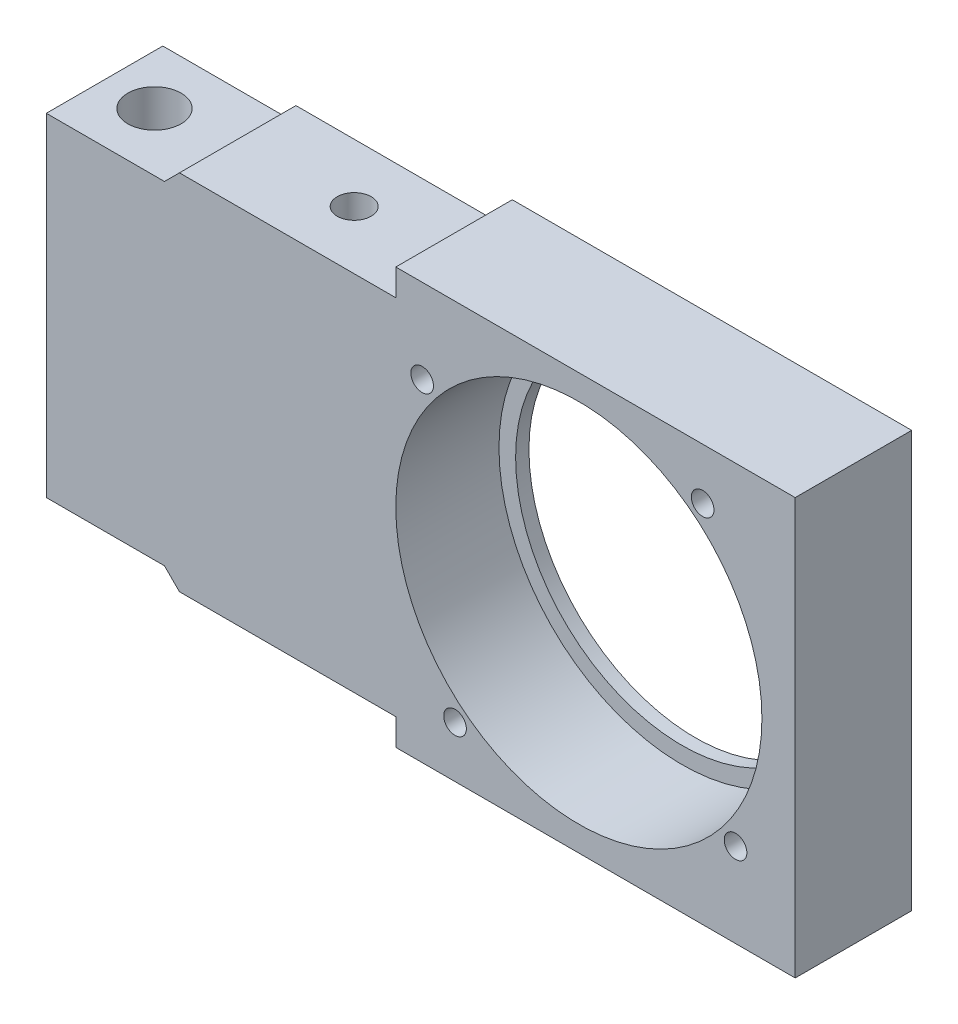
from build123d import *

# Parameters (mm, degrees)
EXTRUSION1_DEPTH             = 17.5
TROU_TARAUD_M12X1_751_D      = 10.2
TROU_TARAUD_M12X1_751_DEPTH  = 32.75
TROU_TARAUD_M12X1_751_TIP    = 3.064389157
ENL_V_MAT_EXTRU_1_DEPTH      = 173.662966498
ENL_V_MAT_EXTRU_1_DEPTH_BACK = 173.662966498
ESQUISSE5_R                  = 8
TROU_TARAUD_M8X1_251_D       = 6.8
TROU_TARAUD_M8X1_251_DEPTH   = 22.25
TROU_TARAUD_M8X1_251_TIP     = 2.042926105


with BuildPart() as part:
    # Esquisse1 → Extrusion1 (new, symmetric)
    with BuildSketch(Plane.XY):
        Polygon((65, -62.5), (65, 62.5), (-55, 62.5), (-55, 54.5), (-120, 54.5), (-124.5, 50), (-160, 50), (-160, -50), (-124.5, -50), (-120, -54.5), (-55, -54.5), (-55, -62.5), align=None)
    extrude(amount=EXTRUSION1_DEPTH, both=True)

    # Esquisse2 → Enl_vement de mati_re-R_volution1 (revolve, cut)
    with BuildSketch(Plane(origin=(0, 0, 0), x_dir=(1, 0, 0), z_dir=(0, 1, 0)), mode=Mode.PRIVATE) as enl_vement_de_mati_re_r_volution1_sk:
        Polygon((50, 27.5), (50, 13.5), (55, 13.5), (55, -27.5), (0, -27.5), (0, 27.5), align=None)
    revolve(enl_vement_de_mati_re_r_volution1_sk.sketch.rotate(Axis((0, 0, -39.915966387), (0, 0, 1)), 180), axis=Axis((0, 0, -39.915966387), (0, 0, 1)), mode=Mode.SUBTRACT)

    # Trou taraud_ M12x1.751
    with Locations(Plane(origin=(0, 54.5, 0), x_dir=(-1, 0, 0), z_dir=(0, 1, 0))):
        with Locations((85, 0)):
            Hole(TROU_TARAUD_M12X1_751_D / 2, depth=TROU_TARAUD_M12X1_751_DEPTH)
            with Locations((0, 0, -(TROU_TARAUD_M12X1_751_DEPTH + TROU_TARAUD_M12X1_751_TIP / 2))):  # 118° drill point
                Cone(0, TROU_TARAUD_M12X1_751_D / 2, TROU_TARAUD_M12X1_751_TIP, mode=Mode.SUBTRACT)

    # Esquisse5 → Enl_v. mat.-Extru.1 (cut, two sides: drawn at the far end of the back side and taken through both)
    with BuildSketch(Plane(origin=(0, 0, 0), x_dir=(1, 0, 0), z_dir=(0, 1, 0)).offset(-ENL_V_MAT_EXTRU_1_DEPTH_BACK)):
        with Locations(Location((-145, 0, 0), (0, 0, 180))):
            Circle(ESQUISSE5_R)
    extrude(amount=ENL_V_MAT_EXTRU_1_DEPTH + ENL_V_MAT_EXTRU_1_DEPTH_BACK, mode=Mode.SUBTRACT)

    # Trou taraud_ M8x1.251
    with Locations(Plane.XY.offset(17.5)):
        with Locations((37.195451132, 47.079702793), (47.079702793, -37.195451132), (-37.195451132, -47.079702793), (-47.079702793, 37.195451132)):
            Hole(TROU_TARAUD_M8X1_251_D / 2, depth=TROU_TARAUD_M8X1_251_DEPTH)
            with Locations((0, 0, -(TROU_TARAUD_M8X1_251_DEPTH + TROU_TARAUD_M8X1_251_TIP / 2))):  # 118° drill point
                Cone(0, TROU_TARAUD_M8X1_251_D / 2, TROU_TARAUD_M8X1_251_TIP, mode=Mode.SUBTRACT)


solid = part.part
